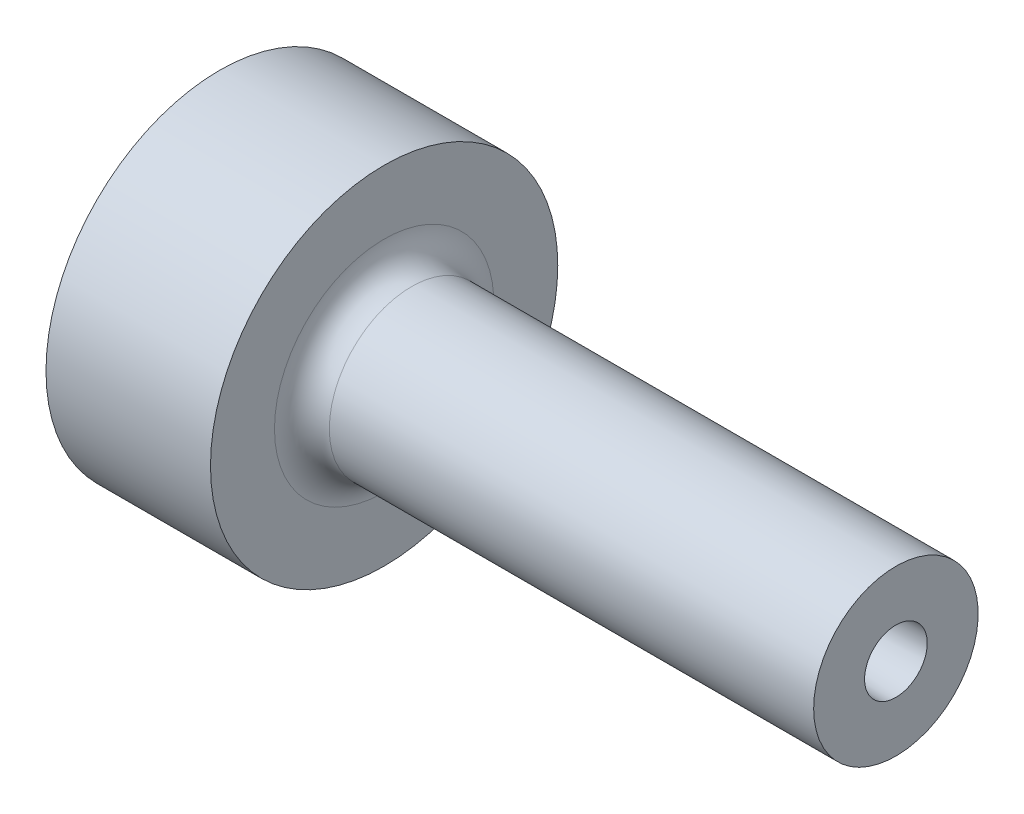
ISO-10303-21;
HEADER;
FILE_DESCRIPTION(('STEP AP214'),'2;1');
FILE_NAME('part.step','',(''),(''),'','','');
FILE_SCHEMA(('AUTOMOTIVE_DESIGN { 1 0 10303 214 1 1 1 1 }'));
ENDSEC;
DATA;
#1=APPLICATION_CONTEXT('core data for automotive mechanical design processes');
#2=APPLICATION_PROTOCOL_DEFINITION('international standard','automotive_design',2000,#1);
#3=PRODUCT_CONTEXT('',#1,'mechanical');
#4=PRODUCT('Part','Part','',(#3));
#5=PRODUCT_RELATED_PRODUCT_CATEGORY('part','',(#4));
#6=PRODUCT_DEFINITION_FORMATION('','',#4);
#7=PRODUCT_DEFINITION_CONTEXT('part definition',#1,'design');
#8=PRODUCT_DEFINITION('design','',#6,#7);
#9=PRODUCT_DEFINITION_SHAPE('','',#8);
#10=(LENGTH_UNIT() NAMED_UNIT(*) SI_UNIT(.MILLI.,.METRE.));
#11=(NAMED_UNIT(*) PLANE_ANGLE_UNIT() SI_UNIT($,.RADIAN.));
#12=(NAMED_UNIT(*) SI_UNIT($,.STERADIAN.) SOLID_ANGLE_UNIT());
#13=UNCERTAINTY_MEASURE_WITH_UNIT(LENGTH_MEASURE(1.E-05),#10,'distance_accuracy_value','');
#14=(GEOMETRIC_REPRESENTATION_CONTEXT(3) GLOBAL_UNCERTAINTY_ASSIGNED_CONTEXT((#13)) GLOBAL_UNIT_ASSIGNED_CONTEXT((#10,
#11,#12)) REPRESENTATION_CONTEXT('',''));
#15=CARTESIAN_POINT('',(0.,0.,0.));
#16=DIRECTION('',(0.,0.,1.));
#17=DIRECTION('',(1.,0.,0.));
#18=AXIS2_PLACEMENT_3D('',#15,#16,#17);
#19=CARTESIAN_POINT('',(0.,0.,0.));
#20=DIRECTION('',(-1.,0.,0.));
#21=DIRECTION('',(0.,0.,1.));
#22=AXIS2_PLACEMENT_3D('',#19,#20,#21);
#23=CYLINDRICAL_SURFACE('',#22,19.);
#24=CARTESIAN_POINT('',(18.,0.,0.));
#25=DIRECTION('',(-1.,0.,0.));
#26=DIRECTION('',(0.,0.,1.));
#27=AXIS2_PLACEMENT_3D('',#24,#25,#26);
#28=CIRCLE('',#27,19.);
#29=CARTESIAN_POINT('',(18.,0.,19.));
#30=VERTEX_POINT('',#29);
#31=EDGE_CURVE('E90',#30,#30,#28,.T.);
#32=ORIENTED_EDGE('',*,*,#31,.T.);
#33=EDGE_LOOP('',(#32));
#34=FACE_BOUND('',#33,.T.);
#35=CARTESIAN_POINT('',(0.,0.,0.));
#36=DIRECTION('',(-1.,0.,0.));
#37=DIRECTION('',(0.,0.,1.));
#38=AXIS2_PLACEMENT_3D('',#35,#36,#37);
#39=CIRCLE('',#38,19.);
#40=CARTESIAN_POINT('',(0.,0.,19.));
#41=VERTEX_POINT('',#40);
#42=EDGE_CURVE('E84',#41,#41,#39,.T.);
#43=ORIENTED_EDGE('',*,*,#42,.F.);
#44=EDGE_LOOP('',(#43));
#45=FACE_BOUND('',#44,.T.);
#46=CARTESIAN_POINT('',(11.,-19.,0.));
#47=CARTESIAN_POINT('',(10.9999951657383,-18.9999986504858,0.11200841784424));
#48=CARTESIAN_POINT('',(10.9905588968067,-18.9989990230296,0.224090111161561));
#49=CARTESIAN_POINT('',(10.953059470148,-18.9951074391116,0.445143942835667));
#50=CARTESIAN_POINT('',(10.9249759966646,-18.9922134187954,0.554112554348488));
#51=CARTESIAN_POINT('',(10.8510107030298,-18.9848596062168,0.765707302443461));
#52=CARTESIAN_POINT('',(10.8051398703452,-18.9804007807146,0.868337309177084));
#53=CARTESIAN_POINT('',(10.696923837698,-18.9704154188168,1.06441973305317));
#54=CARTESIAN_POINT('',(10.6345818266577,-18.9648890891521,1.15787392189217));
#55=CARTESIAN_POINT('',(10.494927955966,-18.9533628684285,1.33334438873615));
#56=CARTESIAN_POINT('',(10.417564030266,-18.9473613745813,1.41531912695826));
#57=CARTESIAN_POINT('',(10.2501736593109,-18.9355744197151,1.565146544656));
#58=CARTESIAN_POINT('',(10.1601466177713,-18.9297889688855,1.63299855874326));
#59=CARTESIAN_POINT('',(9.96972339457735,-18.9190729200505,1.75280323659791));
#60=CARTESIAN_POINT('',(9.86930325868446,-18.914144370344,1.80471802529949));
#61=CARTESIAN_POINT('',(9.66111022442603,-18.9057203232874,1.89093273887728));
#62=CARTESIAN_POINT('',(9.55333752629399,-18.90222478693,1.92523314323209));
#63=CARTESIAN_POINT('',(9.333924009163,-18.8970772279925,1.97512160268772));
#64=CARTESIAN_POINT('',(9.22229908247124,-18.89541839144,1.99077883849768));
#65=CARTESIAN_POINT('',(8.99799439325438,-18.8941109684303,2.0031504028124));
#66=CARTESIAN_POINT('',(8.88531466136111,-18.8944623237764,1.99986527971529));
#67=CARTESIAN_POINT('',(8.66257681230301,-18.8971293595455,1.97450235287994));
#68=CARTESIAN_POINT('',(8.55250997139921,-18.8994371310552,1.9525002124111));
#69=CARTESIAN_POINT('',(8.33763983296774,-18.9057446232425,1.89044560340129));
#70=CARTESIAN_POINT('',(8.23283661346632,-18.9097443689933,1.85039286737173));
#71=CARTESIAN_POINT('',(8.0312304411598,-18.9189942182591,1.75329092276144));
#72=CARTESIAN_POINT('',(7.93444370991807,-18.924246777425,1.69620827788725));
#73=CARTESIAN_POINT('',(7.75179548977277,-18.9354083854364,1.5666908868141));
#74=CARTESIAN_POINT('',(7.66593435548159,-18.9413174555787,1.49425564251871));
#75=CARTESIAN_POINT('',(7.50713503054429,-18.9531615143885,1.33566725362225));
#76=CARTESIAN_POINT('',(7.43426205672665,-18.9590964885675,1.24944878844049));
#77=CARTESIAN_POINT('',(7.30401357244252,-18.9702964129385,1.06596783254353));
#78=CARTESIAN_POINT('',(7.24663808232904,-18.9755613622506,0.968705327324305));
#79=CARTESIAN_POINT('',(7.14901535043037,-18.9848300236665,0.765851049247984));
#80=CARTESIAN_POINT('',(7.10877156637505,-18.9888334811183,0.660257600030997));
#81=CARTESIAN_POINT('',(7.04660317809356,-18.9951255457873,0.443760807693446));
#82=CARTESIAN_POINT('',(7.02467796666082,-18.9974142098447,0.332857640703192));
#83=CARTESIAN_POINT('',(6.9998521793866,-19.0000115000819,0.109454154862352));
#84=CARTESIAN_POINT('',(6.9968616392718,-19.0003294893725,-0.00303606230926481));
#85=CARTESIAN_POINT('',(7.00975357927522,-18.9989747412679,-0.226916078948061));
#86=CARTESIAN_POINT('',(7.02563577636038,-18.9973020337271,-0.338305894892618));
#87=CARTESIAN_POINT('',(7.07574769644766,-18.9921598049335,-0.556562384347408));
#88=CARTESIAN_POINT('',(7.10993514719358,-18.9886944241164,-0.663438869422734));
#89=CARTESIAN_POINT('',(7.1956435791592,-18.9803554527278,-0.869940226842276));
#90=CARTESIAN_POINT('',(7.24716498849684,-18.9754818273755,-0.969564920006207));
#91=CARTESIAN_POINT('',(7.36630089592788,-18.9648478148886,-1.1591405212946));
#92=CARTESIAN_POINT('',(7.43397432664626,-18.9590842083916,-1.2490542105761));
#93=CARTESIAN_POINT('',(7.58340899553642,-18.9473268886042,-1.4162783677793));
#94=CARTESIAN_POINT('',(7.665170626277,-18.9413331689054,-1.49358848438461));
#95=CARTESIAN_POINT('',(7.84085406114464,-18.9297628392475,-1.63372463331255));
#96=CARTESIAN_POINT('',(7.93482318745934,-18.9241879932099,-1.69649150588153));
#97=CARTESIAN_POINT('',(8.13202150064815,-18.9141138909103,-1.80535237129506));
#98=CARTESIAN_POINT('',(8.23525054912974,-18.9096146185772,-1.85144661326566));
#99=CARTESIAN_POINT('',(8.44783784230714,-18.9022123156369,-1.9255553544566));
#100=CARTESIAN_POINT('',(8.55718382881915,-18.8993062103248,-1.95360469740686));
#101=CARTESIAN_POINT('',(8.77906579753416,-18.8954098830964,-1.99094032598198));
#102=CARTESIAN_POINT('',(8.89160167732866,-18.8944195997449,-2.00022721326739));
#103=CARTESIAN_POINT('',(9.11608086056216,-18.8944684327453,-1.99976544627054));
#104=CARTESIAN_POINT('',(9.22802436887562,-18.8954976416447,-1.99010972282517));
#105=CARTESIAN_POINT('',(9.4486892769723,-18.8994483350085,-1.95223204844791));
#106=CARTESIAN_POINT('',(9.55741067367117,-18.9023698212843,-1.92401007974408));
#107=CARTESIAN_POINT('',(9.76854219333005,-18.9097730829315,-1.8498273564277));
#108=CARTESIAN_POINT('',(9.87095340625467,-18.914254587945,-1.80386967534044));
#109=CARTESIAN_POINT('',(10.0666237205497,-18.92427346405,-1.69552954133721));
#110=CARTESIAN_POINT('',(10.1598828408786,-18.9298108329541,-1.63314712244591));
#111=CARTESIAN_POINT('',(10.3350778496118,-18.9413500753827,-1.49337993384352));
#112=CARTESIAN_POINT('',(10.4169583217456,-18.9473540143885,-1.41592586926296));
#113=CARTESIAN_POINT('',(10.5665993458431,-18.9591311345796,-1.24835332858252));
#114=CARTESIAN_POINT('',(10.6343565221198,-18.9649042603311,-1.15823183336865));
#115=CARTESIAN_POINT('',(10.7539774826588,-18.975586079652,-0.967607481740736));
#116=CARTESIAN_POINT('',(10.8057969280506,-18.9804923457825,-0.867076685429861));
#117=CARTESIAN_POINT('',(10.8917493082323,-18.9888617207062,-0.658751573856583));
#118=CARTESIAN_POINT('',(10.9259020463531,-18.9923264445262,-0.550965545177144));
#119=CARTESIAN_POINT('',(10.9671005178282,-18.9965585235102,-0.368815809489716));
#120=CARTESIAN_POINT('',(10.9794208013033,-18.9978430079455,-0.295613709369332));
#121=CARTESIAN_POINT('',(10.9958721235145,-18.9995641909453,-0.148285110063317));
#122=CARTESIAN_POINT('',(11.0000032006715,-19.0000008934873,-0.0741586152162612));
#123=CARTESIAN_POINT('',(11.,-19.,0.));
#124=B_SPLINE_CURVE_WITH_KNOTS('',3,(#46,#47,#48,#49,#50,#51,#52,#53,#54,#55,#56,#57,#58,#59,
#60,#61,#62,#63,#64,#65,#66,#67,#68,#69,#70,#71,#72,#73,#74,#75,#76,#77,#78,#79,#80,#81,#82,#83,
#84,#85,#86,#87,#88,#89,#90,#91,#92,#93,#94,#95,#96,#97,#98,#99,#100,#101,#102,#103,#104,#105,
#106,#107,#108,#109,#110,#111,#112,#113,#114,#115,#116,#117,#118,#119,#120,#121,#122,#123),
.UNSPECIFIED.,.T.,.F.,(4,2,2,2,2,2,2,2,2,2,2,2,2,2,2,2,2,2,2,2,2,2,2,2,2,2,2,2,2,2,2,2,2,2,2,2,
2,2,4),(0.,0.335754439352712,0.671875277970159,1.00778882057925,1.34363737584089,
1.68067146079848,2.01772142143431,2.35556629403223,2.69340196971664,3.02998006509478,
3.36654841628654,3.7017626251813,4.03698180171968,4.37286352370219,4.70875614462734,
5.0462905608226,5.38382542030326,5.72142837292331,6.05902013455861,6.39500668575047,
6.73098819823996,7.06619715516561,7.40141439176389,7.73787392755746,8.07434284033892,
8.41215732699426,8.74996676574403,9.08712193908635,9.42426630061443,9.75976079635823,
10.095255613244,10.4306923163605,10.7661283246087,11.103144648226,11.4402414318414,
11.7782677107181,12.1159142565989,12.3382118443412,12.5605083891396),.UNSPECIFIED.);
#125=CARTESIAN_POINT('',(11.,-19.,0.));
#126=VERTEX_POINT('',#125);
#127=EDGE_CURVE('E10',#126,#126,#124,.T.);
#128=ORIENTED_EDGE('',*,*,#127,.F.);
#129=EDGE_LOOP('',(#128));
#130=FACE_BOUND('',#129,.T.);
#131=ADVANCED_FACE('F16',(#34,#45,#130),#23,.T.);
#132=CARTESIAN_POINT('',(0.,0.,0.));
#133=DIRECTION('',(1.,0.,0.));
#134=DIRECTION('',(0.,0.,-1.));
#135=AXIS2_PLACEMENT_3D('',#132,#133,#134);
#136=CONICAL_SURFACE('',#135,1.75,0.0226892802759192);
#137=CARTESIAN_POINT('',(74.,0.,0.));
#138=DIRECTION('',(-1.,0.,0.));
#139=DIRECTION('',(0.,0.,1.));
#140=AXIS2_PLACEMENT_3D('',#137,#138,#139);
#141=CIRCLE('',#140,3.42929491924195);
#142=CARTESIAN_POINT('',(74.,0.,3.42929491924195));
#143=VERTEX_POINT('',#142);
#144=EDGE_CURVE('E77',#143,#143,#141,.T.);
#145=ORIENTED_EDGE('',*,*,#144,.F.);
#146=EDGE_LOOP('',(#145));
#147=FACE_BOUND('',#146,.T.);
#148=CARTESIAN_POINT('',(3.86351757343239,0.,0.));
#149=DIRECTION('',(-1.,0.,0.));
#150=DIRECTION('',(0.,0.,1.));
#151=AXIS2_PLACEMENT_3D('',#148,#149,#150);
#152=CIRCLE('',#151,1.83767547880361);
#153=CARTESIAN_POINT('',(3.86351757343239,0.,1.83767547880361));
#154=VERTEX_POINT('',#153);
#155=EDGE_CURVE('E97',#154,#154,#152,.F.);
#156=ORIENTED_EDGE('',*,*,#155,.F.);
#157=EDGE_LOOP('',(#156));
#158=FACE_BOUND('',#157,.T.);
#159=ADVANCED_FACE('F44',(#147,#158),#136,.F.);
#160=CARTESIAN_POINT('',(21.,0.,0.));
#161=DIRECTION('',(-1.,0.,0.));
#162=DIRECTION('',(0.,0.,1.));
#163=AXIS2_PLACEMENT_3D('',#160,#161,#162);
#164=TOROIDAL_SURFACE('',#163,12.,3.);
#165=CARTESIAN_POINT('',(18.,0.,0.));
#166=DIRECTION('',(-1.,0.,0.));
#167=DIRECTION('',(0.,0.,1.));
#168=AXIS2_PLACEMENT_3D('',#165,#166,#167);
#169=CIRCLE('',#168,12.);
#170=CARTESIAN_POINT('',(18.,0.,12.));
#171=VERTEX_POINT('',#170);
#172=EDGE_CURVE('E93',#171,#171,#169,.T.);
#173=ORIENTED_EDGE('',*,*,#172,.F.);
#174=EDGE_LOOP('',(#173));
#175=FACE_BOUND('',#174,.T.);
#176=CARTESIAN_POINT('',(21.,0.,0.));
#177=DIRECTION('',(-1.,0.,0.));
#178=DIRECTION('',(0.,0.,1.));
#179=AXIS2_PLACEMENT_3D('',#176,#177,#178);
#180=CIRCLE('',#179,9.);
#181=CARTESIAN_POINT('',(21.,0.,9.));
#182=VERTEX_POINT('',#181);
#183=EDGE_CURVE('E29',#182,#182,#180,.T.);
#184=ORIENTED_EDGE('',*,*,#183,.T.);
#185=EDGE_LOOP('',(#184));
#186=FACE_BOUND('',#185,.T.);
#187=ADVANCED_FACE('F18',(#175,#186),#164,.F.);
#188=CARTESIAN_POINT('',(0.,0.,0.));
#189=DIRECTION('',(-1.,0.,0.));
#190=DIRECTION('',(0.,0.,1.));
#191=AXIS2_PLACEMENT_3D('',#188,#189,#190);
#192=CYLINDRICAL_SURFACE('',#191,9.);
#193=ORIENTED_EDGE('',*,*,#183,.F.);
#194=EDGE_LOOP('',(#193));
#195=FACE_BOUND('',#194,.T.);
#196=CARTESIAN_POINT('',(74.,0.,0.));
#197=DIRECTION('',(-1.,0.,0.));
#198=DIRECTION('',(0.,0.,1.));
#199=AXIS2_PLACEMENT_3D('',#196,#197,#198);
#200=CIRCLE('',#199,9.);
#201=CARTESIAN_POINT('',(74.,0.,9.));
#202=VERTEX_POINT('',#201);
#203=EDGE_CURVE('E75',#202,#202,#200,.T.);
#204=ORIENTED_EDGE('',*,*,#203,.T.);
#205=EDGE_LOOP('',(#204));
#206=FACE_BOUND('',#205,.T.);
#207=ADVANCED_FACE('F63',(#195,#206),#192,.T.);
#208=CARTESIAN_POINT('',(74.,9.,0.));
#209=DIRECTION('',(-1.,0.,0.));
#210=DIRECTION('',(0.,0.,1.));
#211=AXIS2_PLACEMENT_3D('',#208,#209,#210);
#212=PLANE('',#211);
#213=ORIENTED_EDGE('',*,*,#203,.F.);
#214=EDGE_LOOP('',(#213));
#215=FACE_BOUND('',#214,.T.);
#216=ORIENTED_EDGE('',*,*,#144,.T.);
#217=EDGE_LOOP('',(#216));
#218=FACE_BOUND('',#217,.T.);
#219=ADVANCED_FACE('F59',(#215,#218),#212,.F.);
#220=CARTESIAN_POINT('',(0.,1.75,0.));
#221=DIRECTION('',(1.,0.,0.));
#222=DIRECTION('',(0.,0.,-1.));
#223=AXIS2_PLACEMENT_3D('',#220,#221,#222);
#224=PLANE('',#223);
#225=CARTESIAN_POINT('',(0.,0.,0.));
#226=DIRECTION('',(-1.,0.,0.));
#227=DIRECTION('',(0.,0.,1.));
#228=AXIS2_PLACEMENT_3D('',#225,#226,#227);
#229=CIRCLE('',#228,15.5);
#230=CARTESIAN_POINT('',(0.,0.,15.5));
#231=VERTEX_POINT('',#230);
#232=EDGE_CURVE('E100',#231,#231,#229,.T.);
#233=ORIENTED_EDGE('',*,*,#232,.F.);
#234=EDGE_LOOP('',(#233));
#235=FACE_BOUND('',#234,.T.);
#236=ORIENTED_EDGE('',*,*,#42,.T.);
#237=EDGE_LOOP('',(#236));
#238=FACE_BOUND('',#237,.T.);
#239=ADVANCED_FACE('F57',(#235,#238),#224,.F.);
#240=CARTESIAN_POINT('',(18.,19.,0.));
#241=DIRECTION('',(-1.,0.,0.));
#242=DIRECTION('',(0.,0.,1.));
#243=AXIS2_PLACEMENT_3D('',#240,#241,#242);
#244=PLANE('',#243);
#245=ORIENTED_EDGE('',*,*,#31,.F.);
#246=EDGE_LOOP('',(#245));
#247=FACE_BOUND('',#246,.T.);
#248=ORIENTED_EDGE('',*,*,#172,.T.);
#249=EDGE_LOOP('',(#248));
#250=FACE_BOUND('',#249,.T.);
#251=ADVANCED_FACE('F55',(#247,#250),#244,.F.);
#252=CARTESIAN_POINT('',(-35.9477938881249,0.,0.));
#253=DIRECTION('',(-1.,0.,0.));
#254=DIRECTION('',(0.,0.,1.));
#255=AXIS2_PLACEMENT_3D('',#252,#253,#254);
#256=DEGENERATE_TOROIDAL_SURFACE('',#255,2.0429790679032,40.,.F.);
#257=ORIENTED_EDGE('',*,*,#232,.T.);
#258=EDGE_LOOP('',(#257));
#259=FACE_BOUND('',#258,.T.);
#260=ORIENTED_EDGE('',*,*,#155,.T.);
#261=EDGE_LOOP('',(#260));
#262=FACE_BOUND('',#261,.T.);
#263=ADVANCED_FACE('F40',(#259,#262),#256,.T.);
#264=CARTESIAN_POINT('',(9.,-19.,0.));
#265=DIRECTION('',(0.,-1.,0.));
#266=DIRECTION('',(1.,0.,0.));
#267=AXIS2_PLACEMENT_3D('',#264,#265,#266);
#268=CYLINDRICAL_SURFACE('',#267,2.);
#269=CARTESIAN_POINT('',(9.,-13.,0.));
#270=DIRECTION('',(0.,-1.,0.));
#271=DIRECTION('',(1.,0.,0.));
#272=AXIS2_PLACEMENT_3D('',#269,#270,#271);
#273=CIRCLE('',#272,2.);
#274=CARTESIAN_POINT('',(11.,-13.,0.));
#275=VERTEX_POINT('',#274);
#276=EDGE_CURVE('E104',#275,#275,#273,.T.);
#277=ORIENTED_EDGE('',*,*,#276,.F.);
#278=EDGE_LOOP('',(#277));
#279=FACE_BOUND('',#278,.T.);
#280=ORIENTED_EDGE('',*,*,#127,.T.);
#281=EDGE_LOOP('',(#280));
#282=FACE_BOUND('',#281,.T.);
#283=ADVANCED_FACE('F34',(#279,#282),#268,.F.);
#284=CARTESIAN_POINT('',(9.,-11.8452994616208,0.));
#285=DIRECTION('',(0.,-1.,0.));
#286=DIRECTION('',(1.,0.,0.));
#287=AXIS2_PLACEMENT_3D('',#284,#285,#286);
#288=CONICAL_SURFACE('',#287,0.,1.0471975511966);
#289=ORIENTED_EDGE('',*,*,#276,.T.);
#290=EDGE_LOOP('',(#289));
#291=FACE_BOUND('',#290,.T.);
#292=CARTESIAN_POINT('',(9.,-11.8452994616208,0.));
#293=VERTEX_POINT('',#292);
#294=VERTEX_LOOP('',#293);
#295=FACE_BOUND('',#294,.T.);
#296=ADVANCED_FACE('F32',(#291,#295),#288,.F.);
#297=CLOSED_SHELL('',(#131,#159,#187,#207,#219,#239,#251,#263,#283,#296));
#298=MANIFOLD_SOLID_BREP('B1',#297);
#299=ADVANCED_BREP_SHAPE_REPRESENTATION('',(#18,#298),#14);
#300=SHAPE_DEFINITION_REPRESENTATION(#9,#299);
ENDSEC;
END-ISO-10303-21;
